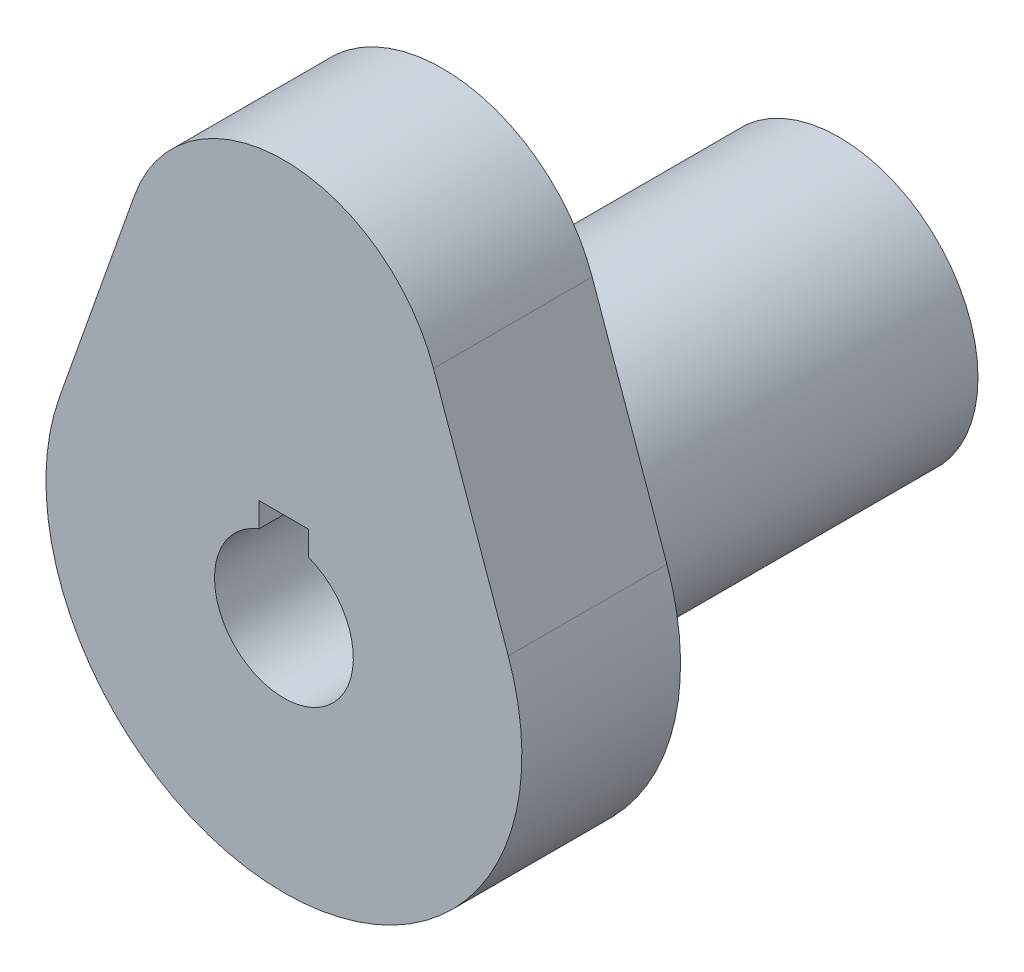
ISO-10303-21;
HEADER;
FILE_DESCRIPTION(('STEP AP214'),'2;1');
FILE_NAME('part.step','',(''),(''),'','','');
FILE_SCHEMA(('AUTOMOTIVE_DESIGN { 1 0 10303 214 1 1 1 1 }'));
ENDSEC;
DATA;
#1=APPLICATION_CONTEXT('core data for automotive mechanical design processes');
#2=APPLICATION_PROTOCOL_DEFINITION('international standard','automotive_design',2000,#1);
#3=PRODUCT_CONTEXT('',#1,'mechanical');
#4=PRODUCT('Part','Part','',(#3));
#5=PRODUCT_RELATED_PRODUCT_CATEGORY('part','',(#4));
#6=PRODUCT_DEFINITION_FORMATION('','',#4);
#7=PRODUCT_DEFINITION_CONTEXT('part definition',#1,'design');
#8=PRODUCT_DEFINITION('design','',#6,#7);
#9=PRODUCT_DEFINITION_SHAPE('','',#8);
#10=(LENGTH_UNIT() NAMED_UNIT(*) SI_UNIT(.MILLI.,.METRE.));
#11=(NAMED_UNIT(*) PLANE_ANGLE_UNIT() SI_UNIT($,.RADIAN.));
#12=(NAMED_UNIT(*) SI_UNIT($,.STERADIAN.) SOLID_ANGLE_UNIT());
#13=UNCERTAINTY_MEASURE_WITH_UNIT(LENGTH_MEASURE(1.E-05),#10,'distance_accuracy_value','');
#14=(GEOMETRIC_REPRESENTATION_CONTEXT(3) GLOBAL_UNCERTAINTY_ASSIGNED_CONTEXT((#13)) GLOBAL_UNIT_ASSIGNED_CONTEXT((#10,
#11,#12)) REPRESENTATION_CONTEXT('',''));
#15=CARTESIAN_POINT('',(0.,0.,0.));
#16=DIRECTION('',(0.,0.,1.));
#17=DIRECTION('',(1.,0.,0.));
#18=AXIS2_PLACEMENT_3D('',#15,#16,#17);
#19=CARTESIAN_POINT('',(0.,0.,0.));
#20=DIRECTION('',(0.,0.,1.));
#21=DIRECTION('',(1.,0.,0.));
#22=AXIS2_PLACEMENT_3D('',#19,#20,#21);
#23=PLANE('',#22);
#24=CARTESIAN_POINT('',(0.,0.,0.));
#25=DIRECTION('',(0.,0.,1.));
#26=DIRECTION('',(1.,0.,0.));
#27=AXIS2_PLACEMENT_3D('',#24,#25,#26);
#28=CIRCLE('',#27,304.8);
#29=CARTESIAN_POINT('',(-287.368195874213,101.6,0.));
#30=VERTEX_POINT('',#29);
#31=CARTESIAN_POINT('',(287.368195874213,101.6,0.));
#32=VERTEX_POINT('',#31);
#33=EDGE_CURVE('E143',#30,#32,#28,.T.);
#34=ORIENTED_EDGE('',*,*,#33,.F.);
#35=DIRECTION('',(-0.333333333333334,-0.942809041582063,0.));
#36=VECTOR('',#35,1.);
#37=CARTESIAN_POINT('',(-287.368195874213,101.6,0.));
#38=LINE('',#37,#36);
#39=CARTESIAN_POINT('',(-191.578797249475,372.533333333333,0.));
#40=VERTEX_POINT('',#39);
#41=EDGE_CURVE('E79',#40,#30,#38,.T.);
#42=ORIENTED_EDGE('',*,*,#41,.F.);
#43=CARTESIAN_POINT('',(0.,304.8,0.));
#44=DIRECTION('',(0.,0.,1.));
#45=DIRECTION('',(1.,0.,0.));
#46=AXIS2_PLACEMENT_3D('',#43,#44,#45);
#47=CIRCLE('',#46,203.2);
#48=CARTESIAN_POINT('',(191.578797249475,372.533333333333,0.));
#49=VERTEX_POINT('',#48);
#50=EDGE_CURVE('E155',#49,#40,#47,.T.);
#51=ORIENTED_EDGE('',*,*,#50,.F.);
#52=DIRECTION('',(-0.333333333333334,0.942809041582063,0.));
#53=VECTOR('',#52,1.);
#54=CARTESIAN_POINT('',(287.368195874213,101.6,0.));
#55=LINE('',#54,#53);
#56=EDGE_CURVE('E153',#32,#49,#55,.T.);
#57=ORIENTED_EDGE('',*,*,#56,.F.);
#58=EDGE_LOOP('',(#34,#42,#51,#57));
#59=FACE_BOUND('',#58,.T.);
#60=CARTESIAN_POINT('',(0.,0.,0.));
#61=DIRECTION('',(0.,0.,1.));
#62=DIRECTION('',(1.,0.,0.));
#63=AXIS2_PLACEMENT_3D('',#60,#61,#62);
#64=CIRCLE('',#63,177.8);
#65=CARTESIAN_POINT('',(177.8,0.,0.));
#66=VERTEX_POINT('',#65);
#67=EDGE_CURVE('E11',#66,#66,#64,.F.);
#68=ORIENTED_EDGE('',*,*,#67,.F.);
#69=EDGE_LOOP('',(#68));
#70=FACE_BOUND('',#69,.T.);
#71=ADVANCED_FACE('F34',(#59,#70),#23,.F.);
#72=CARTESIAN_POINT('',(0.,0.,203.2));
#73=DIRECTION('',(0.,0.,1.));
#74=DIRECTION('',(1.,0.,0.));
#75=AXIS2_PLACEMENT_3D('',#72,#73,#74);
#76=PLANE('',#75);
#77=DIRECTION('',(0.,-1.,0.));
#78=VECTOR('',#77,1.);
#79=CARTESIAN_POINT('',(-31.75,114.3,203.2));
#80=LINE('',#79,#78);
#81=CARTESIAN_POINT('',(-31.75,114.3,203.2));
#82=VERTEX_POINT('',#81);
#83=CARTESIAN_POINT('',(-31.75,83.0370248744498,203.2));
#84=VERTEX_POINT('',#83);
#85=EDGE_CURVE('E114',#82,#84,#80,.T.);
#86=ORIENTED_EDGE('',*,*,#85,.F.);
#87=DIRECTION('',(-1.,0.,0.));
#88=VECTOR('',#87,1.);
#89=CARTESIAN_POINT('',(-31.75,114.3,203.2));
#90=LINE('',#89,#88);
#91=CARTESIAN_POINT('',(31.75,114.3,203.2));
#92=VERTEX_POINT('',#91);
#93=EDGE_CURVE('E128',#92,#82,#90,.T.);
#94=ORIENTED_EDGE('',*,*,#93,.F.);
#95=DIRECTION('',(0.,1.,0.));
#96=VECTOR('',#95,1.);
#97=CARTESIAN_POINT('',(31.75,114.3,203.2));
#98=LINE('',#97,#96);
#99=CARTESIAN_POINT('',(31.75,83.0370248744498,203.2));
#100=VERTEX_POINT('',#99);
#101=EDGE_CURVE('E282',#100,#92,#98,.T.);
#102=ORIENTED_EDGE('',*,*,#101,.F.);
#103=CARTESIAN_POINT('',(0.,0.,203.2));
#104=DIRECTION('',(0.,0.,1.));
#105=DIRECTION('',(1.,0.,0.));
#106=AXIS2_PLACEMENT_3D('',#103,#104,#105);
#107=CIRCLE('',#106,88.9);
#108=EDGE_CURVE('E136',#84,#100,#107,.T.);
#109=ORIENTED_EDGE('',*,*,#108,.F.);
#110=EDGE_LOOP('',(#86,#94,#102,#109));
#111=FACE_BOUND('',#110,.T.);
#112=CARTESIAN_POINT('',(0.,0.,203.2));
#113=DIRECTION('',(0.,0.,1.));
#114=DIRECTION('',(1.,0.,0.));
#115=AXIS2_PLACEMENT_3D('',#112,#113,#114);
#116=CIRCLE('',#115,304.8);
#117=CARTESIAN_POINT('',(-287.368195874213,101.6,203.2));
#118=VERTEX_POINT('',#117);
#119=CARTESIAN_POINT('',(287.368195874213,101.6,203.2));
#120=VERTEX_POINT('',#119);
#121=EDGE_CURVE('E144',#118,#120,#116,.T.);
#122=ORIENTED_EDGE('',*,*,#121,.T.);
#123=DIRECTION('',(-0.333333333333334,0.942809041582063,0.));
#124=VECTOR('',#123,1.);
#125=CARTESIAN_POINT('',(287.368195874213,101.6,203.2));
#126=LINE('',#125,#124);
#127=CARTESIAN_POINT('',(191.578797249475,372.533333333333,203.2));
#128=VERTEX_POINT('',#127);
#129=EDGE_CURVE('E87',#120,#128,#126,.T.);
#130=ORIENTED_EDGE('',*,*,#129,.T.);
#131=CARTESIAN_POINT('',(0.,304.8,203.2));
#132=DIRECTION('',(0.,0.,1.));
#133=DIRECTION('',(1.,0.,0.));
#134=AXIS2_PLACEMENT_3D('',#131,#132,#133);
#135=CIRCLE('',#134,203.2);
#136=CARTESIAN_POINT('',(-191.578797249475,372.533333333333,203.2));
#137=VERTEX_POINT('',#136);
#138=EDGE_CURVE('E147',#128,#137,#135,.T.);
#139=ORIENTED_EDGE('',*,*,#138,.T.);
#140=DIRECTION('',(-0.333333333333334,-0.942809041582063,0.));
#141=VECTOR('',#140,1.);
#142=CARTESIAN_POINT('',(-287.368195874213,101.6,203.2));
#143=LINE('',#142,#141);
#144=EDGE_CURVE('E58',#137,#118,#143,.T.);
#145=ORIENTED_EDGE('',*,*,#144,.T.);
#146=EDGE_LOOP('',(#122,#130,#139,#145));
#147=FACE_BOUND('',#146,.T.);
#148=ADVANCED_FACE('F176',(#111,#147),#76,.T.);
#149=CARTESIAN_POINT('',(0.,0.,203.2));
#150=DIRECTION('',(0.,0.,-1.));
#151=DIRECTION('',(-1.,0.,0.));
#152=AXIS2_PLACEMENT_3D('',#149,#150,#151);
#153=CYLINDRICAL_SURFACE('',#152,304.8);
#154=ORIENTED_EDGE('',*,*,#33,.T.);
#155=DIRECTION('',(0.,0.,-1.));
#156=VECTOR('',#155,1.);
#157=CARTESIAN_POINT('',(287.368195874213,101.6,203.2));
#158=LINE('',#157,#156);
#159=EDGE_CURVE('E42',#120,#32,#158,.T.);
#160=ORIENTED_EDGE('',*,*,#159,.F.);
#161=ORIENTED_EDGE('',*,*,#121,.F.);
#162=DIRECTION('',(0.,0.,-1.));
#163=VECTOR('',#162,1.);
#164=CARTESIAN_POINT('',(-287.368195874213,101.6,203.2));
#165=LINE('',#164,#163);
#166=EDGE_CURVE('E150',#118,#30,#165,.T.);
#167=ORIENTED_EDGE('',*,*,#166,.T.);
#168=EDGE_LOOP('',(#154,#160,#161,#167));
#169=FACE_BOUND('',#168,.T.);
#170=ADVANCED_FACE('F36',(#169),#153,.T.);
#171=CARTESIAN_POINT('',(287.368195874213,101.6,203.2));
#172=DIRECTION('',(-0.942809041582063,-0.333333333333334,0.));
#173=DIRECTION('',(0.333333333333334,-0.942809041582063,0.));
#174=AXIS2_PLACEMENT_3D('',#171,#172,#173);
#175=PLANE('',#174);
#176=ORIENTED_EDGE('',*,*,#56,.T.);
#177=DIRECTION('',(0.,0.,-1.));
#178=VECTOR('',#177,1.);
#179=CARTESIAN_POINT('',(191.578797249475,372.533333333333,203.2));
#180=LINE('',#179,#178);
#181=EDGE_CURVE('E161',#128,#49,#180,.T.);
#182=ORIENTED_EDGE('',*,*,#181,.F.);
#183=ORIENTED_EDGE('',*,*,#129,.F.);
#184=ORIENTED_EDGE('',*,*,#159,.T.);
#185=EDGE_LOOP('',(#176,#182,#183,#184));
#186=FACE_BOUND('',#185,.T.);
#187=ADVANCED_FACE('F164',(#186),#175,.F.);
#188=CARTESIAN_POINT('',(0.,304.8,203.2));
#189=DIRECTION('',(0.,0.,-1.));
#190=DIRECTION('',(-1.,0.,0.));
#191=AXIS2_PLACEMENT_3D('',#188,#189,#190);
#192=CYLINDRICAL_SURFACE('',#191,203.2);
#193=ORIENTED_EDGE('',*,*,#50,.T.);
#194=DIRECTION('',(0.,0.,-1.));
#195=VECTOR('',#194,1.);
#196=CARTESIAN_POINT('',(-191.578797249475,372.533333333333,203.2));
#197=LINE('',#196,#195);
#198=EDGE_CURVE('E159',#137,#40,#197,.T.);
#199=ORIENTED_EDGE('',*,*,#198,.F.);
#200=ORIENTED_EDGE('',*,*,#138,.F.);
#201=ORIENTED_EDGE('',*,*,#181,.T.);
#202=EDGE_LOOP('',(#193,#199,#200,#201));
#203=FACE_BOUND('',#202,.T.);
#204=ADVANCED_FACE('F173',(#203),#192,.T.);
#205=CARTESIAN_POINT('',(-287.368195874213,101.6,203.2));
#206=DIRECTION('',(0.942809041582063,-0.333333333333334,0.));
#207=DIRECTION('',(0.333333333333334,0.942809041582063,0.));
#208=AXIS2_PLACEMENT_3D('',#205,#206,#207);
#209=PLANE('',#208);
#210=ORIENTED_EDGE('',*,*,#41,.T.);
#211=ORIENTED_EDGE('',*,*,#166,.F.);
#212=ORIENTED_EDGE('',*,*,#144,.F.);
#213=ORIENTED_EDGE('',*,*,#198,.T.);
#214=EDGE_LOOP('',(#210,#211,#212,#213));
#215=FACE_BOUND('',#214,.T.);
#216=ADVANCED_FACE('F175',(#215),#209,.F.);
#217=CARTESIAN_POINT('',(0.,0.,203.2));
#218=DIRECTION('',(0.,0.,-1.));
#219=DIRECTION('',(-1.,0.,0.));
#220=AXIS2_PLACEMENT_3D('',#217,#218,#219);
#221=CYLINDRICAL_SURFACE('',#220,88.9);
#222=DIRECTION('',(0.,0.,1.));
#223=VECTOR('',#222,1.);
#224=CARTESIAN_POINT('',(-31.75,83.0370248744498,-508.));
#225=LINE('',#224,#223);
#226=CARTESIAN_POINT('',(-31.75,83.0370248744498,-508.));
#227=VERTEX_POINT('',#226);
#228=EDGE_CURVE('E109',#227,#84,#225,.T.);
#229=ORIENTED_EDGE('',*,*,#228,.T.);
#230=ORIENTED_EDGE('',*,*,#108,.T.);
#231=DIRECTION('',(0.,0.,1.));
#232=VECTOR('',#231,1.);
#233=CARTESIAN_POINT('',(31.75,83.0370248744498,-508.));
#234=LINE('',#233,#232);
#235=CARTESIAN_POINT('',(31.75,83.0370248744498,-508.));
#236=VERTEX_POINT('',#235);
#237=EDGE_CURVE('E119',#236,#100,#234,.T.);
#238=ORIENTED_EDGE('',*,*,#237,.F.);
#239=CARTESIAN_POINT('',(0.,0.,-508.));
#240=DIRECTION('',(0.,0.,-1.));
#241=DIRECTION('',(-1.,0.,0.));
#242=AXIS2_PLACEMENT_3D('',#239,#240,#241);
#243=CIRCLE('',#242,88.9);
#244=EDGE_CURVE('E126',#236,#227,#243,.T.);
#245=ORIENTED_EDGE('',*,*,#244,.T.);
#246=EDGE_LOOP('',(#229,#230,#238,#245));
#247=FACE_BOUND('',#246,.T.);
#248=ADVANCED_FACE('F131',(#247),#221,.F.);
#249=CARTESIAN_POINT('',(0.,0.,-508.));
#250=DIRECTION('',(0.,0.,-1.));
#251=DIRECTION('',(-1.,0.,0.));
#252=AXIS2_PLACEMENT_3D('',#249,#250,#251);
#253=PLANE('',#252);
#254=DIRECTION('',(0.,-1.,0.));
#255=VECTOR('',#254,1.);
#256=CARTESIAN_POINT('',(-31.75,114.3,-508.));
#257=LINE('',#256,#255);
#258=CARTESIAN_POINT('',(-31.75,114.3,-508.));
#259=VERTEX_POINT('',#258);
#260=EDGE_CURVE('E112',#259,#227,#257,.T.);
#261=ORIENTED_EDGE('',*,*,#260,.T.);
#262=ORIENTED_EDGE('',*,*,#244,.F.);
#263=DIRECTION('',(0.,1.,0.));
#264=VECTOR('',#263,1.);
#265=CARTESIAN_POINT('',(31.75,114.3,-508.));
#266=LINE('',#265,#264);
#267=CARTESIAN_POINT('',(31.75,114.3,-508.));
#268=VERTEX_POINT('',#267);
#269=EDGE_CURVE('E127',#236,#268,#266,.T.);
#270=ORIENTED_EDGE('',*,*,#269,.T.);
#271=DIRECTION('',(-1.,0.,0.));
#272=VECTOR('',#271,1.);
#273=CARTESIAN_POINT('',(-31.75,114.3,-508.));
#274=LINE('',#273,#272);
#275=EDGE_CURVE('E49',#268,#259,#274,.T.);
#276=ORIENTED_EDGE('',*,*,#275,.T.);
#277=EDGE_LOOP('',(#261,#262,#270,#276));
#278=FACE_BOUND('',#277,.T.);
#279=CARTESIAN_POINT('',(0.,0.,-508.));
#280=DIRECTION('',(0.,0.,-1.));
#281=DIRECTION('',(-1.,0.,0.));
#282=AXIS2_PLACEMENT_3D('',#279,#280,#281);
#283=CIRCLE('',#282,177.8);
#284=CARTESIAN_POINT('',(-177.8,0.,-508.));
#285=VERTEX_POINT('',#284);
#286=EDGE_CURVE('E132',#285,#285,#283,.T.);
#287=ORIENTED_EDGE('',*,*,#286,.T.);
#288=EDGE_LOOP('',(#287));
#289=FACE_BOUND('',#288,.T.);
#290=ADVANCED_FACE('F123',(#278,#289),#253,.T.);
#291=CARTESIAN_POINT('',(0.,0.,-508.));
#292=DIRECTION('',(0.,0.,1.));
#293=DIRECTION('',(1.,0.,0.));
#294=AXIS2_PLACEMENT_3D('',#291,#292,#293);
#295=CYLINDRICAL_SURFACE('',#294,177.8);
#296=ORIENTED_EDGE('',*,*,#286,.F.);
#297=EDGE_LOOP('',(#296));
#298=FACE_BOUND('',#297,.T.);
#299=ORIENTED_EDGE('',*,*,#67,.T.);
#300=EDGE_LOOP('',(#299));
#301=FACE_BOUND('',#300,.T.);
#302=ADVANCED_FACE('F216',(#298,#301),#295,.T.);
#303=CARTESIAN_POINT('',(-31.75,114.3,-508.));
#304=DIRECTION('',(-1.,0.,0.));
#305=DIRECTION('',(0.,0.,1.));
#306=AXIS2_PLACEMENT_3D('',#303,#304,#305);
#307=PLANE('',#306);
#308=ORIENTED_EDGE('',*,*,#85,.T.);
#309=ORIENTED_EDGE('',*,*,#228,.F.);
#310=ORIENTED_EDGE('',*,*,#260,.F.);
#311=DIRECTION('',(0.,0.,1.));
#312=VECTOR('',#311,1.);
#313=CARTESIAN_POINT('',(-31.75,114.3,-508.));
#314=LINE('',#313,#312);
#315=EDGE_CURVE('E133',#259,#82,#314,.T.);
#316=ORIENTED_EDGE('',*,*,#315,.T.);
#317=EDGE_LOOP('',(#308,#309,#310,#316));
#318=FACE_BOUND('',#317,.T.);
#319=ADVANCED_FACE('F111',(#318),#307,.F.);
#320=CARTESIAN_POINT('',(-31.75,114.3,-508.));
#321=DIRECTION('',(0.,1.,0.));
#322=DIRECTION('',(0.,0.,1.));
#323=AXIS2_PLACEMENT_3D('',#320,#321,#322);
#324=PLANE('',#323);
#325=ORIENTED_EDGE('',*,*,#93,.T.);
#326=ORIENTED_EDGE('',*,*,#315,.F.);
#327=ORIENTED_EDGE('',*,*,#275,.F.);
#328=DIRECTION('',(0.,0.,1.));
#329=VECTOR('',#328,1.);
#330=CARTESIAN_POINT('',(31.75,114.3,-508.));
#331=LINE('',#330,#329);
#332=EDGE_CURVE('E138',#268,#92,#331,.T.);
#333=ORIENTED_EDGE('',*,*,#332,.T.);
#334=EDGE_LOOP('',(#325,#326,#327,#333));
#335=FACE_BOUND('',#334,.T.);
#336=ADVANCED_FACE('F229',(#335),#324,.F.);
#337=CARTESIAN_POINT('',(31.75,114.3,-508.));
#338=DIRECTION('',(1.,0.,0.));
#339=DIRECTION('',(0.,0.,-1.));
#340=AXIS2_PLACEMENT_3D('',#337,#338,#339);
#341=PLANE('',#340);
#342=ORIENTED_EDGE('',*,*,#101,.T.);
#343=ORIENTED_EDGE('',*,*,#332,.F.);
#344=ORIENTED_EDGE('',*,*,#269,.F.);
#345=ORIENTED_EDGE('',*,*,#237,.T.);
#346=EDGE_LOOP('',(#342,#343,#344,#345));
#347=FACE_BOUND('',#346,.T.);
#348=ADVANCED_FACE('F236',(#347),#341,.F.);
#349=CLOSED_SHELL('',(#71,#148,#170,#187,#204,#216,#248,#290,#302,#319,#336,#348));
#350=MANIFOLD_SOLID_BREP('B2',#349);
#351=ADVANCED_BREP_SHAPE_REPRESENTATION('',(#18,#350),#14);
#352=SHAPE_DEFINITION_REPRESENTATION(#9,#351);
ENDSEC;
END-ISO-10303-21;
